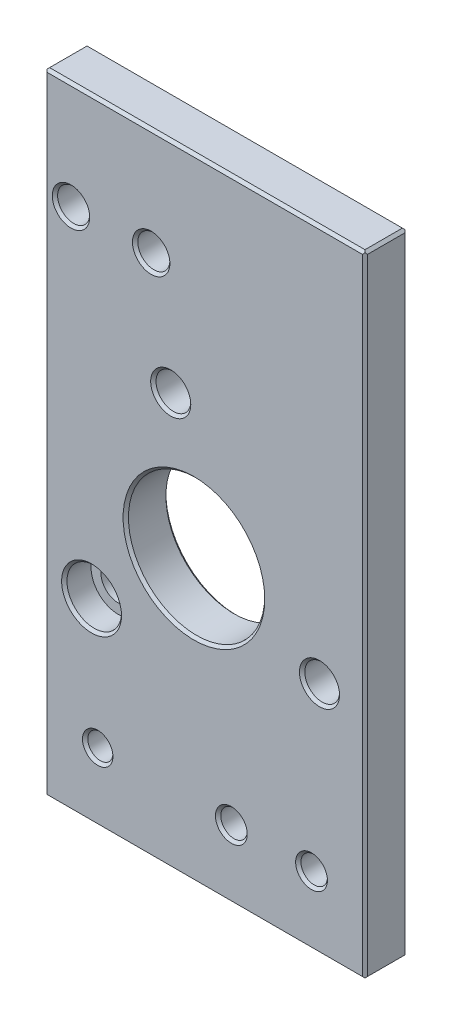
ISO-10303-21;
HEADER;
FILE_DESCRIPTION(('STEP AP214'),'2;1');
FILE_NAME('part.step','',(''),(''),'','','');
FILE_SCHEMA(('AUTOMOTIVE_DESIGN { 1 0 10303 214 1 1 1 1 }'));
ENDSEC;
DATA;
#1=APPLICATION_CONTEXT('core data for automotive mechanical design processes');
#2=APPLICATION_PROTOCOL_DEFINITION('international standard','automotive_design',2000,#1);
#3=PRODUCT_CONTEXT('',#1,'mechanical');
#4=PRODUCT('Part','Part','',(#3));
#5=PRODUCT_RELATED_PRODUCT_CATEGORY('part','',(#4));
#6=PRODUCT_DEFINITION_FORMATION('','',#4);
#7=PRODUCT_DEFINITION_CONTEXT('part definition',#1,'design');
#8=PRODUCT_DEFINITION('design','',#6,#7);
#9=PRODUCT_DEFINITION_SHAPE('','',#8);
#10=(LENGTH_UNIT() NAMED_UNIT(*) SI_UNIT(.MILLI.,.METRE.));
#11=(NAMED_UNIT(*) PLANE_ANGLE_UNIT() SI_UNIT($,.RADIAN.));
#12=(NAMED_UNIT(*) SI_UNIT($,.STERADIAN.) SOLID_ANGLE_UNIT());
#13=UNCERTAINTY_MEASURE_WITH_UNIT(LENGTH_MEASURE(1.E-05),#10,'distance_accuracy_value','');
#14=(GEOMETRIC_REPRESENTATION_CONTEXT(3) GLOBAL_UNCERTAINTY_ASSIGNED_CONTEXT((#13)) GLOBAL_UNIT_ASSIGNED_CONTEXT((#10,
#11,#12)) REPRESENTATION_CONTEXT('',''));
#15=CARTESIAN_POINT('',(0.,0.,0.));
#16=DIRECTION('',(0.,0.,1.));
#17=DIRECTION('',(1.,0.,0.));
#18=AXIS2_PLACEMENT_3D('',#15,#16,#17);
#19=CARTESIAN_POINT('',(8.8488889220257,36.4303097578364,-2.));
#20=DIRECTION('',(0.,0.,1.));
#21=DIRECTION('',(1.,0.,0.));
#22=AXIS2_PLACEMENT_3D('',#19,#20,#21);
#23=CYLINDRICAL_SURFACE('',#22,3.25);
#24=CARTESIAN_POINT('',(8.8488889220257,36.4303097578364,0.500000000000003));
#25=DIRECTION('',(0.,0.,1.));
#26=DIRECTION('',(1.,0.,0.));
#27=AXIS2_PLACEMENT_3D('',#24,#25,#26);
#28=CIRCLE('',#27,3.25);
#29=CARTESIAN_POINT('',(12.0988889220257,36.4303097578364,0.500000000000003));
#30=VERTEX_POINT('',#29);
#31=EDGE_CURVE('E278',#30,#30,#28,.F.);
#32=ORIENTED_EDGE('',*,*,#31,.T.);
#33=EDGE_LOOP('',(#32));
#34=FACE_BOUND('',#33,.T.);
#35=CARTESIAN_POINT('',(8.8488889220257,36.4303097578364,3.));
#36=DIRECTION('',(0.,0.,1.));
#37=DIRECTION('',(1.,0.,0.));
#38=AXIS2_PLACEMENT_3D('',#35,#36,#37);
#39=CIRCLE('',#38,3.25);
#40=CARTESIAN_POINT('',(12.0988889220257,36.4303097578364,3.));
#41=VERTEX_POINT('',#40);
#42=EDGE_CURVE('E368',#41,#41,#39,.F.);
#43=ORIENTED_EDGE('',*,*,#42,.F.);
#44=EDGE_LOOP('',(#43));
#45=FACE_BOUND('',#44,.T.);
#46=ADVANCED_FACE('F34',(#34,#45),#23,.F.);
#47=CARTESIAN_POINT('',(0.,0.,8.));
#48=DIRECTION('',(-1.,0.,0.));
#49=DIRECTION('',(0.,0.,1.));
#50=AXIS2_PLACEMENT_3D('',#47,#48,#49);
#51=PLANE('',#50);
#52=DIRECTION('',(0.,1.,0.));
#53=VECTOR('',#52,1.);
#54=CARTESIAN_POINT('',(0.,0.,7.49999999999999));
#55=LINE('',#54,#53);
#56=CARTESIAN_POINT('',(0.,0.500000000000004,7.49999999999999));
#57=VERTEX_POINT('',#56);
#58=CARTESIAN_POINT('',(0.,117.5,7.5));
#59=VERTEX_POINT('',#58);
#60=EDGE_CURVE('E181',#57,#59,#55,.T.);
#61=ORIENTED_EDGE('',*,*,#60,.T.);
#62=DIRECTION('',(0.,0.,-1.));
#63=VECTOR('',#62,1.);
#64=CARTESIAN_POINT('',(0.,117.5,0.500000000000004));
#65=LINE('',#64,#63);
#66=CARTESIAN_POINT('',(0.,117.5,0.50000000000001));
#67=VERTEX_POINT('',#66);
#68=EDGE_CURVE('E327',#59,#67,#65,.T.);
#69=ORIENTED_EDGE('',*,*,#68,.T.);
#70=DIRECTION('',(0.,-1.,0.));
#71=VECTOR('',#70,1.);
#72=CARTESIAN_POINT('',(0.,0.,0.500000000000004));
#73=LINE('',#72,#71);
#74=CARTESIAN_POINT('',(0.,0.500000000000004,0.500000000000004));
#75=VERTEX_POINT('',#74);
#76=EDGE_CURVE('E255',#67,#75,#73,.T.);
#77=ORIENTED_EDGE('',*,*,#76,.T.);
#78=DIRECTION('',(0.,0.,1.));
#79=VECTOR('',#78,1.);
#80=CARTESIAN_POINT('',(0.,0.500000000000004,7.49999999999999));
#81=LINE('',#80,#79);
#82=EDGE_CURVE('E307',#75,#57,#81,.T.);
#83=ORIENTED_EDGE('',*,*,#82,.T.);
#84=EDGE_LOOP('',(#61,#69,#77,#83));
#85=FACE_BOUND('',#84,.T.);
#86=ADVANCED_FACE('F36',(#85),#51,.T.);
#87=CARTESIAN_POINT('',(0.,0.,8.));
#88=DIRECTION('',(0.,1.,0.));
#89=DIRECTION('',(-1.,0.,0.));
#90=AXIS2_PLACEMENT_3D('',#87,#88,#89);
#91=PLANE('',#90);
#92=DIRECTION('',(-1.,0.,0.));
#93=VECTOR('',#92,1.);
#94=CARTESIAN_POINT('',(0.,0.,7.5));
#95=LINE('',#94,#93);
#96=CARTESIAN_POINT('',(59.5,0.,7.5));
#97=VERTEX_POINT('',#96);
#98=CARTESIAN_POINT('',(0.500000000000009,0.,7.5));
#99=VERTEX_POINT('',#98);
#100=EDGE_CURVE('E178',#97,#99,#95,.T.);
#101=ORIENTED_EDGE('',*,*,#100,.T.);
#102=DIRECTION('',(0.,0.,-1.));
#103=VECTOR('',#102,1.);
#104=CARTESIAN_POINT('',(0.500000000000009,0.,0.500000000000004));
#105=LINE('',#104,#103);
#106=CARTESIAN_POINT('',(0.500000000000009,0.,0.500000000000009));
#107=VERTEX_POINT('',#106);
#108=EDGE_CURVE('E299',#99,#107,#105,.T.);
#109=ORIENTED_EDGE('',*,*,#108,.T.);
#110=DIRECTION('',(1.,0.,0.));
#111=VECTOR('',#110,1.);
#112=CARTESIAN_POINT('',(0.,0.,0.500000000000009));
#113=LINE('',#112,#111);
#114=CARTESIAN_POINT('',(59.5,0.,0.500000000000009));
#115=VERTEX_POINT('',#114);
#116=EDGE_CURVE('E211',#107,#115,#113,.T.);
#117=ORIENTED_EDGE('',*,*,#116,.T.);
#118=DIRECTION('',(0.,0.,1.));
#119=VECTOR('',#118,1.);
#120=CARTESIAN_POINT('',(59.5,0.,7.5));
#121=LINE('',#120,#119);
#122=EDGE_CURVE('E292',#115,#97,#121,.T.);
#123=ORIENTED_EDGE('',*,*,#122,.T.);
#124=EDGE_LOOP('',(#101,#109,#117,#123));
#125=FACE_BOUND('',#124,.T.);
#126=ADVANCED_FACE('F432',(#125),#91,.F.);
#127=CARTESIAN_POINT('',(60.,118.,8.));
#128=DIRECTION('',(1.,0.,0.));
#129=DIRECTION('',(0.,1.,0.));
#130=AXIS2_PLACEMENT_3D('',#127,#128,#129);
#131=PLANE('',#130);
#132=DIRECTION('',(0.,1.,0.));
#133=VECTOR('',#132,1.);
#134=CARTESIAN_POINT('',(60.,118.,0.500000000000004));
#135=LINE('',#134,#133);
#136=CARTESIAN_POINT('',(60.,0.49999999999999,0.499999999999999));
#137=VERTEX_POINT('',#136);
#138=CARTESIAN_POINT('',(60.,117.5,0.500000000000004));
#139=VERTEX_POINT('',#138);
#140=EDGE_CURVE('E250',#137,#139,#135,.T.);
#141=ORIENTED_EDGE('',*,*,#140,.T.);
#142=DIRECTION('',(0.,0.,1.));
#143=VECTOR('',#142,1.);
#144=CARTESIAN_POINT('',(60.,117.5,7.49999999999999));
#145=LINE('',#144,#143);
#146=CARTESIAN_POINT('',(60.,117.5,7.49999999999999));
#147=VERTEX_POINT('',#146);
#148=EDGE_CURVE('E320',#139,#147,#145,.T.);
#149=ORIENTED_EDGE('',*,*,#148,.T.);
#150=DIRECTION('',(0.,-1.,0.));
#151=VECTOR('',#150,1.);
#152=CARTESIAN_POINT('',(60.,118.,7.49999999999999));
#153=LINE('',#152,#151);
#154=CARTESIAN_POINT('',(60.,0.500000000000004,7.49999999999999));
#155=VERTEX_POINT('',#154);
#156=EDGE_CURVE('E172',#147,#155,#153,.T.);
#157=ORIENTED_EDGE('',*,*,#156,.T.);
#158=DIRECTION('',(0.,0.,-1.));
#159=VECTOR('',#158,1.);
#160=CARTESIAN_POINT('',(60.,0.500000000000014,0.500000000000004));
#161=LINE('',#160,#159);
#162=EDGE_CURVE('E284',#155,#137,#161,.T.);
#163=ORIENTED_EDGE('',*,*,#162,.T.);
#164=EDGE_LOOP('',(#141,#149,#157,#163));
#165=FACE_BOUND('',#164,.T.);
#166=ADVANCED_FACE('F517',(#165),#131,.T.);
#167=CARTESIAN_POINT('',(60.,118.,8.));
#168=DIRECTION('',(0.,-1.,0.));
#169=DIRECTION('',(0.,0.,-1.));
#170=AXIS2_PLACEMENT_3D('',#167,#168,#169);
#171=PLANE('',#170);
#172=DIRECTION('',(-1.,0.,0.));
#173=VECTOR('',#172,1.);
#174=CARTESIAN_POINT('',(60.,118.,0.500000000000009));
#175=LINE('',#174,#173);
#176=CARTESIAN_POINT('',(59.5,118.,0.500000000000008));
#177=VERTEX_POINT('',#176);
#178=CARTESIAN_POINT('',(0.5,118.,0.500000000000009));
#179=VERTEX_POINT('',#178);
#180=EDGE_CURVE('E253',#177,#179,#175,.T.);
#181=ORIENTED_EDGE('',*,*,#180,.T.);
#182=DIRECTION('',(0.,0.,1.));
#183=VECTOR('',#182,1.);
#184=CARTESIAN_POINT('',(0.5,118.,7.49999999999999));
#185=LINE('',#184,#183);
#186=CARTESIAN_POINT('',(0.499999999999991,118.,7.5));
#187=VERTEX_POINT('',#186);
#188=EDGE_CURVE('E56',#179,#187,#185,.T.);
#189=ORIENTED_EDGE('',*,*,#188,.T.);
#190=DIRECTION('',(1.,0.,0.));
#191=VECTOR('',#190,1.);
#192=CARTESIAN_POINT('',(60.,118.,7.5));
#193=LINE('',#192,#191);
#194=CARTESIAN_POINT('',(59.5,118.,7.5));
#195=VERTEX_POINT('',#194);
#196=EDGE_CURVE('E170',#187,#195,#193,.T.);
#197=ORIENTED_EDGE('',*,*,#196,.T.);
#198=DIRECTION('',(0.,0.,-1.));
#199=VECTOR('',#198,1.);
#200=CARTESIAN_POINT('',(59.5,118.,0.500000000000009));
#201=LINE('',#200,#199);
#202=EDGE_CURVE('E313',#195,#177,#201,.T.);
#203=ORIENTED_EDGE('',*,*,#202,.T.);
#204=EDGE_LOOP('',(#181,#189,#197,#203));
#205=FACE_BOUND('',#204,.T.);
#206=ADVANCED_FACE('F341',(#205),#171,.F.);
#207=CARTESIAN_POINT('',(0.,118.,8.));
#208=DIRECTION('',(0.,0.,1.));
#209=DIRECTION('',(1.,0.,0.));
#210=AXIS2_PLACEMENT_3D('',#207,#208,#209);
#211=PLANE('',#210);
#212=DIRECTION('',(0.,1.,0.));
#213=VECTOR('',#212,1.);
#214=CARTESIAN_POINT('',(59.5,118.,8.));
#215=LINE('',#214,#213);
#216=CARTESIAN_POINT('',(59.5,0.500000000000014,8.));
#217=VERTEX_POINT('',#216);
#218=CARTESIAN_POINT('',(59.5,117.5,8.));
#219=VERTEX_POINT('',#218);
#220=EDGE_CURVE('E168',#217,#219,#215,.T.);
#221=ORIENTED_EDGE('',*,*,#220,.T.);
#222=DIRECTION('',(-1.,0.,0.));
#223=VECTOR('',#222,1.);
#224=CARTESIAN_POINT('',(0.,117.5,8.));
#225=LINE('',#224,#223);
#226=CARTESIAN_POINT('',(0.500000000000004,117.5,8.));
#227=VERTEX_POINT('',#226);
#228=EDGE_CURVE('E149',#219,#227,#225,.T.);
#229=ORIENTED_EDGE('',*,*,#228,.T.);
#230=DIRECTION('',(0.,-1.,0.));
#231=VECTOR('',#230,1.);
#232=CARTESIAN_POINT('',(0.500000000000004,118.,8.));
#233=LINE('',#232,#231);
#234=CARTESIAN_POINT('',(0.500000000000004,0.500000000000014,8.));
#235=VERTEX_POINT('',#234);
#236=EDGE_CURVE('E156',#227,#235,#233,.T.);
#237=ORIENTED_EDGE('',*,*,#236,.T.);
#238=DIRECTION('',(1.,0.,0.));
#239=VECTOR('',#238,1.);
#240=CARTESIAN_POINT('',(60.,0.500000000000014,8.));
#241=LINE('',#240,#239);
#242=EDGE_CURVE('E162',#235,#217,#241,.T.);
#243=ORIENTED_EDGE('',*,*,#242,.T.);
#244=EDGE_LOOP('',(#221,#229,#237,#243));
#245=FACE_BOUND('',#244,.T.);
#246=CARTESIAN_POINT('',(28.,52.5,8.));
#247=DIRECTION('',(0.,0.,1.));
#248=DIRECTION('',(1.,0.,0.));
#249=AXIS2_PLACEMENT_3D('',#246,#247,#248);
#250=CIRCLE('',#249,13.25);
#251=CARTESIAN_POINT('',(41.25,52.5,8.));
#252=VERTEX_POINT('',#251);
#253=EDGE_CURVE('E163',#252,#252,#250,.F.);
#254=ORIENTED_EDGE('',*,*,#253,.T.);
#255=EDGE_LOOP('',(#254));
#256=FACE_BOUND('',#255,.T.);
#257=CARTESIAN_POINT('',(5.,98.,8.));
#258=DIRECTION('',(0.,0.,1.));
#259=DIRECTION('',(1.,0.,0.));
#260=AXIS2_PLACEMENT_3D('',#257,#258,#259);
#261=CIRCLE('',#260,3.5);
#262=CARTESIAN_POINT('',(8.5,98.,8.));
#263=VERTEX_POINT('',#262);
#264=EDGE_CURVE('E392',#263,#263,#261,.F.);
#265=ORIENTED_EDGE('',*,*,#264,.T.);
#266=EDGE_LOOP('',(#265));
#267=FACE_BOUND('',#266,.T.);
#268=CARTESIAN_POINT('',(20.,98.,8.));
#269=DIRECTION('',(0.,0.,1.));
#270=DIRECTION('',(1.,0.,0.));
#271=AXIS2_PLACEMENT_3D('',#268,#269,#270);
#272=CIRCLE('',#271,3.5);
#273=CARTESIAN_POINT('',(23.5,98.,8.));
#274=VERTEX_POINT('',#273);
#275=EDGE_CURVE('E389',#274,#274,#272,.F.);
#276=ORIENTED_EDGE('',*,*,#275,.T.);
#277=EDGE_LOOP('',(#276));
#278=FACE_BOUND('',#277,.T.);
#279=CARTESIAN_POINT('',(10.,12.8,8.));
#280=DIRECTION('',(0.,0.,1.));
#281=DIRECTION('',(1.,0.,0.));
#282=AXIS2_PLACEMENT_3D('',#279,#280,#281);
#283=CIRCLE('',#282,2.8475);
#284=CARTESIAN_POINT('',(12.8475,12.8,8.));
#285=VERTEX_POINT('',#284);
#286=EDGE_CURVE('E386',#285,#285,#283,.F.);
#287=ORIENTED_EDGE('',*,*,#286,.T.);
#288=EDGE_LOOP('',(#287));
#289=FACE_BOUND('',#288,.T.);
#290=CARTESIAN_POINT('',(35.,12.8,8.));
#291=DIRECTION('',(0.,0.,1.));
#292=DIRECTION('',(1.,0.,0.));
#293=AXIS2_PLACEMENT_3D('',#290,#291,#292);
#294=CIRCLE('',#293,2.975);
#295=CARTESIAN_POINT('',(37.975,12.8,8.));
#296=VERTEX_POINT('',#295);
#297=EDGE_CURVE('E383',#296,#296,#294,.F.);
#298=ORIENTED_EDGE('',*,*,#297,.T.);
#299=EDGE_LOOP('',(#298));
#300=FACE_BOUND('',#299,.T.);
#301=CARTESIAN_POINT('',(50.,12.8,8.));
#302=DIRECTION('',(0.,0.,1.));
#303=DIRECTION('',(1.,0.,0.));
#304=AXIS2_PLACEMENT_3D('',#301,#302,#303);
#305=CIRCLE('',#304,2.975);
#306=CARTESIAN_POINT('',(52.975,12.8,8.));
#307=VERTEX_POINT('',#306);
#308=EDGE_CURVE('E380',#307,#307,#305,.F.);
#309=ORIENTED_EDGE('',*,*,#308,.T.);
#310=EDGE_LOOP('',(#309));
#311=FACE_BOUND('',#310,.T.);
#312=CARTESIAN_POINT('',(23.6587955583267,77.1201938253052,8.));
#313=DIRECTION('',(0.,0.,1.));
#314=DIRECTION('',(1.,0.,0.));
#315=AXIS2_PLACEMENT_3D('',#312,#313,#314);
#316=CIRCLE('',#315,3.75000000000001);
#317=CARTESIAN_POINT('',(27.4087955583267,77.1201938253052,8.));
#318=VERTEX_POINT('',#317);
#319=EDGE_CURVE('E377',#318,#318,#316,.F.);
#320=ORIENTED_EDGE('',*,*,#319,.T.);
#321=EDGE_LOOP('',(#320));
#322=FACE_BOUND('',#321,.T.);
#323=CARTESIAN_POINT('',(51.4923155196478,43.9494964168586,8.));
#324=DIRECTION('',(0.,0.,1.));
#325=DIRECTION('',(1.,0.,0.));
#326=AXIS2_PLACEMENT_3D('',#323,#324,#325);
#327=CIRCLE('',#326,3.75000000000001);
#328=CARTESIAN_POINT('',(55.2423155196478,43.9494964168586,8.));
#329=VERTEX_POINT('',#328);
#330=EDGE_CURVE('E374',#329,#329,#327,.F.);
#331=ORIENTED_EDGE('',*,*,#330,.T.);
#332=EDGE_LOOP('',(#331));
#333=FACE_BOUND('',#332,.T.);
#334=CARTESIAN_POINT('',(8.8488889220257,36.4303097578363,8.));
#335=DIRECTION('',(0.,0.,1.));
#336=DIRECTION('',(1.,0.,0.));
#337=AXIS2_PLACEMENT_3D('',#334,#335,#336);
#338=CIRCLE('',#337,5.60000000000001);
#339=CARTESIAN_POINT('',(14.4488889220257,36.4303097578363,8.));
#340=VERTEX_POINT('',#339);
#341=EDGE_CURVE('E371',#340,#340,#338,.F.);
#342=ORIENTED_EDGE('',*,*,#341,.T.);
#343=EDGE_LOOP('',(#342));
#344=FACE_BOUND('',#343,.T.);
#345=ADVANCED_FACE('F165',(#245,#256,#267,#278,#289,#300,#311,#322,#333,#344),#211,.T.);
#346=CARTESIAN_POINT('',(0.,118.,0.));
#347=DIRECTION('',(0.,0.,1.));
#348=DIRECTION('',(1.,0.,0.));
#349=AXIS2_PLACEMENT_3D('',#346,#347,#348);
#350=PLANE('',#349);
#351=DIRECTION('',(0.,-1.,0.));
#352=VECTOR('',#351,1.);
#353=CARTESIAN_POINT('',(59.5,0.,0.));
#354=LINE('',#353,#352);
#355=CARTESIAN_POINT('',(59.5,117.5,0.));
#356=VERTEX_POINT('',#355);
#357=CARTESIAN_POINT('',(59.5,0.5,0.));
#358=VERTEX_POINT('',#357);
#359=EDGE_CURVE('E245',#356,#358,#354,.T.);
#360=ORIENTED_EDGE('',*,*,#359,.T.);
#361=DIRECTION('',(-1.,0.,0.));
#362=VECTOR('',#361,1.);
#363=CARTESIAN_POINT('',(0.,0.5,0.));
#364=LINE('',#363,#362);
#365=CARTESIAN_POINT('',(0.500000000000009,0.5,0.));
#366=VERTEX_POINT('',#365);
#367=EDGE_CURVE('E247',#358,#366,#364,.T.);
#368=ORIENTED_EDGE('',*,*,#367,.T.);
#369=DIRECTION('',(0.,1.,0.));
#370=VECTOR('',#369,1.);
#371=CARTESIAN_POINT('',(0.500000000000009,118.,0.));
#372=LINE('',#371,#370);
#373=CARTESIAN_POINT('',(0.500000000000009,117.5,0.));
#374=VERTEX_POINT('',#373);
#375=EDGE_CURVE('E240',#366,#374,#372,.T.);
#376=ORIENTED_EDGE('',*,*,#375,.T.);
#377=DIRECTION('',(1.,0.,0.));
#378=VECTOR('',#377,1.);
#379=CARTESIAN_POINT('',(0.,117.5,0.));
#380=LINE('',#379,#378);
#381=EDGE_CURVE('E243',#374,#356,#380,.T.);
#382=ORIENTED_EDGE('',*,*,#381,.T.);
#383=EDGE_LOOP('',(#360,#368,#376,#382));
#384=FACE_BOUND('',#383,.T.);
#385=CARTESIAN_POINT('',(28.,52.5,0.));
#386=DIRECTION('',(0.,0.,1.));
#387=DIRECTION('',(1.,0.,0.));
#388=AXIS2_PLACEMENT_3D('',#385,#386,#387);
#389=CIRCLE('',#388,13.25);
#390=CARTESIAN_POINT('',(41.25,52.5,0.));
#391=VERTEX_POINT('',#390);
#392=EDGE_CURVE('E237',#391,#391,#389,.T.);
#393=ORIENTED_EDGE('',*,*,#392,.T.);
#394=EDGE_LOOP('',(#393));
#395=FACE_BOUND('',#394,.T.);
#396=CARTESIAN_POINT('',(5.,98.,0.));
#397=DIRECTION('',(0.,0.,1.));
#398=DIRECTION('',(1.,0.,0.));
#399=AXIS2_PLACEMENT_3D('',#396,#397,#398);
#400=CIRCLE('',#399,3.50000000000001);
#401=CARTESIAN_POINT('',(8.50000000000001,98.,0.));
#402=VERTEX_POINT('',#401);
#403=EDGE_CURVE('E234',#402,#402,#400,.T.);
#404=ORIENTED_EDGE('',*,*,#403,.T.);
#405=EDGE_LOOP('',(#404));
#406=FACE_BOUND('',#405,.T.);
#407=CARTESIAN_POINT('',(20.,98.,0.));
#408=DIRECTION('',(0.,0.,1.));
#409=DIRECTION('',(1.,0.,0.));
#410=AXIS2_PLACEMENT_3D('',#407,#408,#409);
#411=CIRCLE('',#410,3.50000000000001);
#412=CARTESIAN_POINT('',(23.5,98.,0.));
#413=VERTEX_POINT('',#412);
#414=EDGE_CURVE('E231',#413,#413,#411,.T.);
#415=ORIENTED_EDGE('',*,*,#414,.T.);
#416=EDGE_LOOP('',(#415));
#417=FACE_BOUND('',#416,.T.);
#418=CARTESIAN_POINT('',(10.,12.8,0.));
#419=DIRECTION('',(0.,0.,1.));
#420=DIRECTION('',(1.,0.,0.));
#421=AXIS2_PLACEMENT_3D('',#418,#419,#420);
#422=CIRCLE('',#421,2.84750000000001);
#423=CARTESIAN_POINT('',(12.8475,12.8,0.));
#424=VERTEX_POINT('',#423);
#425=EDGE_CURVE('E228',#424,#424,#422,.T.);
#426=ORIENTED_EDGE('',*,*,#425,.T.);
#427=EDGE_LOOP('',(#426));
#428=FACE_BOUND('',#427,.T.);
#429=CARTESIAN_POINT('',(35.,12.8,0.));
#430=DIRECTION('',(0.,0.,1.));
#431=DIRECTION('',(1.,0.,0.));
#432=AXIS2_PLACEMENT_3D('',#429,#430,#431);
#433=CIRCLE('',#432,2.97500000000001);
#434=CARTESIAN_POINT('',(37.975,12.8,0.));
#435=VERTEX_POINT('',#434);
#436=EDGE_CURVE('E225',#435,#435,#433,.T.);
#437=ORIENTED_EDGE('',*,*,#436,.T.);
#438=EDGE_LOOP('',(#437));
#439=FACE_BOUND('',#438,.T.);
#440=CARTESIAN_POINT('',(50.,12.8,0.));
#441=DIRECTION('',(0.,0.,1.));
#442=DIRECTION('',(1.,0.,0.));
#443=AXIS2_PLACEMENT_3D('',#440,#441,#442);
#444=CIRCLE('',#443,2.97500000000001);
#445=CARTESIAN_POINT('',(52.975,12.8,0.));
#446=VERTEX_POINT('',#445);
#447=EDGE_CURVE('E222',#446,#446,#444,.T.);
#448=ORIENTED_EDGE('',*,*,#447,.T.);
#449=EDGE_LOOP('',(#448));
#450=FACE_BOUND('',#449,.T.);
#451=CARTESIAN_POINT('',(23.6587955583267,77.1201938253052,0.));
#452=DIRECTION('',(0.,0.,1.));
#453=DIRECTION('',(1.,0.,0.));
#454=AXIS2_PLACEMENT_3D('',#451,#452,#453);
#455=CIRCLE('',#454,3.75000000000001);
#456=CARTESIAN_POINT('',(27.4087955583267,77.1201938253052,0.));
#457=VERTEX_POINT('',#456);
#458=EDGE_CURVE('E219',#457,#457,#455,.T.);
#459=ORIENTED_EDGE('',*,*,#458,.T.);
#460=EDGE_LOOP('',(#459));
#461=FACE_BOUND('',#460,.T.);
#462=CARTESIAN_POINT('',(8.8488889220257,36.4303097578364,0.));
#463=DIRECTION('',(0.,0.,1.));
#464=DIRECTION('',(1.,0.,0.));
#465=AXIS2_PLACEMENT_3D('',#462,#463,#464);
#466=CIRCLE('',#465,3.75000000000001);
#467=CARTESIAN_POINT('',(12.5988889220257,36.4303097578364,0.));
#468=VERTEX_POINT('',#467);
#469=EDGE_CURVE('E216',#468,#468,#466,.T.);
#470=ORIENTED_EDGE('',*,*,#469,.T.);
#471=EDGE_LOOP('',(#470));
#472=FACE_BOUND('',#471,.T.);
#473=CARTESIAN_POINT('',(51.4923155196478,43.9494964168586,0.));
#474=DIRECTION('',(0.,0.,1.));
#475=DIRECTION('',(1.,0.,0.));
#476=AXIS2_PLACEMENT_3D('',#473,#474,#475);
#477=CIRCLE('',#476,3.75000000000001);
#478=CARTESIAN_POINT('',(55.2423155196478,43.9494964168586,0.));
#479=VERTEX_POINT('',#478);
#480=EDGE_CURVE('E213',#479,#479,#477,.T.);
#481=ORIENTED_EDGE('',*,*,#480,.T.);
#482=EDGE_LOOP('',(#481));
#483=FACE_BOUND('',#482,.T.);
#484=ADVANCED_FACE('F438',(#384,#395,#406,#417,#428,#439,#450,#461,#472,#483),#350,.F.);
#485=CARTESIAN_POINT('',(28.,52.5,-2.));
#486=DIRECTION('',(0.,0.,1.));
#487=DIRECTION('',(1.,0.,0.));
#488=AXIS2_PLACEMENT_3D('',#485,#486,#487);
#489=CYLINDRICAL_SURFACE('',#488,12.75);
#490=CARTESIAN_POINT('',(28.,52.5,0.500000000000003));
#491=DIRECTION('',(0.,0.,1.));
#492=DIRECTION('',(1.,0.,0.));
#493=AXIS2_PLACEMENT_3D('',#490,#491,#492);
#494=CIRCLE('',#493,12.75);
#495=CARTESIAN_POINT('',(40.75,52.5,0.500000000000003));
#496=VERTEX_POINT('',#495);
#497=EDGE_CURVE('E257',#496,#496,#494,.F.);
#498=ORIENTED_EDGE('',*,*,#497,.T.);
#499=EDGE_LOOP('',(#498));
#500=FACE_BOUND('',#499,.T.);
#501=CARTESIAN_POINT('',(28.,52.5,7.49999999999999));
#502=DIRECTION('',(0.,0.,1.));
#503=DIRECTION('',(1.,0.,0.));
#504=AXIS2_PLACEMENT_3D('',#501,#502,#503);
#505=CIRCLE('',#504,12.75);
#506=CARTESIAN_POINT('',(40.75,52.5,7.49999999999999));
#507=VERTEX_POINT('',#506);
#508=EDGE_CURVE('E184',#507,#507,#505,.T.);
#509=ORIENTED_EDGE('',*,*,#508,.T.);
#510=EDGE_LOOP('',(#509));
#511=FACE_BOUND('',#510,.T.);
#512=ADVANCED_FACE('F441',(#500,#511),#489,.F.);
#513=CARTESIAN_POINT('',(5.,98.,-2.));
#514=DIRECTION('',(0.,0.,1.));
#515=DIRECTION('',(1.,0.,0.));
#516=AXIS2_PLACEMENT_3D('',#513,#514,#515);
#517=CYLINDRICAL_SURFACE('',#516,3.);
#518=CARTESIAN_POINT('',(5.,98.,0.500000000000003));
#519=DIRECTION('',(0.,0.,1.));
#520=DIRECTION('',(1.,0.,0.));
#521=AXIS2_PLACEMENT_3D('',#518,#519,#520);
#522=CIRCLE('',#521,3.);
#523=CARTESIAN_POINT('',(8.,98.,0.500000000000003));
#524=VERTEX_POINT('',#523);
#525=EDGE_CURVE('E260',#524,#524,#522,.F.);
#526=ORIENTED_EDGE('',*,*,#525,.T.);
#527=EDGE_LOOP('',(#526));
#528=FACE_BOUND('',#527,.T.);
#529=CARTESIAN_POINT('',(5.,98.,7.49999999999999));
#530=DIRECTION('',(0.,0.,1.));
#531=DIRECTION('',(1.,0.,0.));
#532=AXIS2_PLACEMENT_3D('',#529,#530,#531);
#533=CIRCLE('',#532,3.);
#534=CARTESIAN_POINT('',(8.,98.,7.49999999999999));
#535=VERTEX_POINT('',#534);
#536=EDGE_CURVE('E187',#535,#535,#533,.T.);
#537=ORIENTED_EDGE('',*,*,#536,.T.);
#538=EDGE_LOOP('',(#537));
#539=FACE_BOUND('',#538,.T.);
#540=ADVANCED_FACE('F505',(#528,#539),#517,.F.);
#541=CARTESIAN_POINT('',(20.,98.,-2.));
#542=DIRECTION('',(0.,0.,1.));
#543=DIRECTION('',(1.,0.,0.));
#544=AXIS2_PLACEMENT_3D('',#541,#542,#543);
#545=CYLINDRICAL_SURFACE('',#544,3.);
#546=CARTESIAN_POINT('',(20.,98.,0.500000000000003));
#547=DIRECTION('',(0.,0.,1.));
#548=DIRECTION('',(1.,0.,0.));
#549=AXIS2_PLACEMENT_3D('',#546,#547,#548);
#550=CIRCLE('',#549,3.);
#551=CARTESIAN_POINT('',(23.,98.,0.500000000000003));
#552=VERTEX_POINT('',#551);
#553=EDGE_CURVE('E263',#552,#552,#550,.F.);
#554=ORIENTED_EDGE('',*,*,#553,.T.);
#555=EDGE_LOOP('',(#554));
#556=FACE_BOUND('',#555,.T.);
#557=CARTESIAN_POINT('',(20.,98.,7.49999999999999));
#558=DIRECTION('',(0.,0.,1.));
#559=DIRECTION('',(1.,0.,0.));
#560=AXIS2_PLACEMENT_3D('',#557,#558,#559);
#561=CIRCLE('',#560,3.);
#562=CARTESIAN_POINT('',(23.,98.,7.49999999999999));
#563=VERTEX_POINT('',#562);
#564=EDGE_CURVE('E190',#563,#563,#561,.T.);
#565=ORIENTED_EDGE('',*,*,#564,.T.);
#566=EDGE_LOOP('',(#565));
#567=FACE_BOUND('',#566,.T.);
#568=ADVANCED_FACE('F501',(#556,#567),#545,.F.);
#569=CARTESIAN_POINT('',(10.,12.8,-2.));
#570=DIRECTION('',(0.,0.,1.));
#571=DIRECTION('',(1.,0.,0.));
#572=AXIS2_PLACEMENT_3D('',#569,#570,#571);
#573=CYLINDRICAL_SURFACE('',#572,2.3475);
#574=CARTESIAN_POINT('',(10.,12.8,0.500000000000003));
#575=DIRECTION('',(0.,0.,1.));
#576=DIRECTION('',(1.,0.,0.));
#577=AXIS2_PLACEMENT_3D('',#574,#575,#576);
#578=CIRCLE('',#577,2.3475);
#579=CARTESIAN_POINT('',(12.3475,12.8,0.500000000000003));
#580=VERTEX_POINT('',#579);
#581=EDGE_CURVE('E266',#580,#580,#578,.F.);
#582=ORIENTED_EDGE('',*,*,#581,.T.);
#583=EDGE_LOOP('',(#582));
#584=FACE_BOUND('',#583,.T.);
#585=CARTESIAN_POINT('',(10.,12.8,7.49999999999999));
#586=DIRECTION('',(0.,0.,1.));
#587=DIRECTION('',(1.,0.,0.));
#588=AXIS2_PLACEMENT_3D('',#585,#586,#587);
#589=CIRCLE('',#588,2.3475);
#590=CARTESIAN_POINT('',(12.3475,12.8,7.49999999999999));
#591=VERTEX_POINT('',#590);
#592=EDGE_CURVE('E193',#591,#591,#589,.T.);
#593=ORIENTED_EDGE('',*,*,#592,.T.);
#594=EDGE_LOOP('',(#593));
#595=FACE_BOUND('',#594,.T.);
#596=ADVANCED_FACE('F497',(#584,#595),#573,.F.);
#597=CARTESIAN_POINT('',(35.,12.8,-2.));
#598=DIRECTION('',(0.,0.,1.));
#599=DIRECTION('',(1.,0.,0.));
#600=AXIS2_PLACEMENT_3D('',#597,#598,#599);
#601=CYLINDRICAL_SURFACE('',#600,2.475);
#602=CARTESIAN_POINT('',(35.,12.8,0.500000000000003));
#603=DIRECTION('',(0.,0.,1.));
#604=DIRECTION('',(1.,0.,0.));
#605=AXIS2_PLACEMENT_3D('',#602,#603,#604);
#606=CIRCLE('',#605,2.475);
#607=CARTESIAN_POINT('',(37.475,12.8,0.500000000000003));
#608=VERTEX_POINT('',#607);
#609=EDGE_CURVE('E269',#608,#608,#606,.F.);
#610=ORIENTED_EDGE('',*,*,#609,.T.);
#611=EDGE_LOOP('',(#610));
#612=FACE_BOUND('',#611,.T.);
#613=CARTESIAN_POINT('',(35.,12.8,7.49999999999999));
#614=DIRECTION('',(0.,0.,1.));
#615=DIRECTION('',(1.,0.,0.));
#616=AXIS2_PLACEMENT_3D('',#613,#614,#615);
#617=CIRCLE('',#616,2.475);
#618=CARTESIAN_POINT('',(37.475,12.8,7.49999999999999));
#619=VERTEX_POINT('',#618);
#620=EDGE_CURVE('E196',#619,#619,#617,.T.);
#621=ORIENTED_EDGE('',*,*,#620,.T.);
#622=EDGE_LOOP('',(#621));
#623=FACE_BOUND('',#622,.T.);
#624=ADVANCED_FACE('F493',(#612,#623),#601,.F.);
#625=CARTESIAN_POINT('',(50.,12.8,-2.));
#626=DIRECTION('',(0.,0.,1.));
#627=DIRECTION('',(1.,0.,0.));
#628=AXIS2_PLACEMENT_3D('',#625,#626,#627);
#629=CYLINDRICAL_SURFACE('',#628,2.475);
#630=CARTESIAN_POINT('',(50.,12.8,0.500000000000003));
#631=DIRECTION('',(0.,0.,1.));
#632=DIRECTION('',(1.,0.,0.));
#633=AXIS2_PLACEMENT_3D('',#630,#631,#632);
#634=CIRCLE('',#633,2.475);
#635=CARTESIAN_POINT('',(52.475,12.8,0.500000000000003));
#636=VERTEX_POINT('',#635);
#637=EDGE_CURVE('E272',#636,#636,#634,.F.);
#638=ORIENTED_EDGE('',*,*,#637,.T.);
#639=EDGE_LOOP('',(#638));
#640=FACE_BOUND('',#639,.T.);
#641=CARTESIAN_POINT('',(50.,12.8,7.49999999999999));
#642=DIRECTION('',(0.,0.,1.));
#643=DIRECTION('',(1.,0.,0.));
#644=AXIS2_PLACEMENT_3D('',#641,#642,#643);
#645=CIRCLE('',#644,2.475);
#646=CARTESIAN_POINT('',(52.475,12.8,7.49999999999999));
#647=VERTEX_POINT('',#646);
#648=EDGE_CURVE('E199',#647,#647,#645,.T.);
#649=ORIENTED_EDGE('',*,*,#648,.T.);
#650=EDGE_LOOP('',(#649));
#651=FACE_BOUND('',#650,.T.);
#652=ADVANCED_FACE('F489',(#640,#651),#629,.F.);
#653=CARTESIAN_POINT('',(23.6587955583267,77.1201938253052,-2.));
#654=DIRECTION('',(0.,0.,1.));
#655=DIRECTION('',(1.,0.,0.));
#656=AXIS2_PLACEMENT_3D('',#653,#654,#655);
#657=CYLINDRICAL_SURFACE('',#656,3.25);
#658=CARTESIAN_POINT('',(23.6587955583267,77.1201938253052,0.500000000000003));
#659=DIRECTION('',(0.,0.,1.));
#660=DIRECTION('',(1.,0.,0.));
#661=AXIS2_PLACEMENT_3D('',#658,#659,#660);
#662=CIRCLE('',#661,3.25);
#663=CARTESIAN_POINT('',(26.9087955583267,77.1201938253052,0.500000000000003));
#664=VERTEX_POINT('',#663);
#665=EDGE_CURVE('E275',#664,#664,#662,.F.);
#666=ORIENTED_EDGE('',*,*,#665,.T.);
#667=EDGE_LOOP('',(#666));
#668=FACE_BOUND('',#667,.T.);
#669=CARTESIAN_POINT('',(23.6587955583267,77.1201938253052,7.49999999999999));
#670=DIRECTION('',(0.,0.,1.));
#671=DIRECTION('',(1.,0.,0.));
#672=AXIS2_PLACEMENT_3D('',#669,#670,#671);
#673=CIRCLE('',#672,3.25);
#674=CARTESIAN_POINT('',(26.9087955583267,77.1201938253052,7.49999999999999));
#675=VERTEX_POINT('',#674);
#676=EDGE_CURVE('E202',#675,#675,#673,.T.);
#677=ORIENTED_EDGE('',*,*,#676,.T.);
#678=EDGE_LOOP('',(#677));
#679=FACE_BOUND('',#678,.T.);
#680=ADVANCED_FACE('F486',(#668,#679),#657,.F.);
#681=CARTESIAN_POINT('',(51.4923155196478,43.9494964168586,-2.));
#682=DIRECTION('',(0.,0.,1.));
#683=DIRECTION('',(1.,0.,0.));
#684=AXIS2_PLACEMENT_3D('',#681,#682,#683);
#685=CYLINDRICAL_SURFACE('',#684,3.25);
#686=CARTESIAN_POINT('',(51.4923155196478,43.9494964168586,0.500000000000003));
#687=DIRECTION('',(0.,0.,1.));
#688=DIRECTION('',(1.,0.,0.));
#689=AXIS2_PLACEMENT_3D('',#686,#687,#688);
#690=CIRCLE('',#689,3.25);
#691=CARTESIAN_POINT('',(54.7423155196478,43.9494964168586,0.500000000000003));
#692=VERTEX_POINT('',#691);
#693=EDGE_CURVE('E281',#692,#692,#690,.F.);
#694=ORIENTED_EDGE('',*,*,#693,.T.);
#695=EDGE_LOOP('',(#694));
#696=FACE_BOUND('',#695,.T.);
#697=CARTESIAN_POINT('',(51.4923155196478,43.9494964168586,7.49999999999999));
#698=DIRECTION('',(0.,0.,1.));
#699=DIRECTION('',(1.,0.,0.));
#700=AXIS2_PLACEMENT_3D('',#697,#698,#699);
#701=CIRCLE('',#700,3.25);
#702=CARTESIAN_POINT('',(54.7423155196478,43.9494964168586,7.49999999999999));
#703=VERTEX_POINT('',#702);
#704=EDGE_CURVE('E205',#703,#703,#701,.T.);
#705=ORIENTED_EDGE('',*,*,#704,.T.);
#706=EDGE_LOOP('',(#705));
#707=FACE_BOUND('',#706,.T.);
#708=ADVANCED_FACE('F484',(#696,#707),#685,.F.);
#709=CARTESIAN_POINT('',(8.8488889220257,36.4303097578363,3.));
#710=DIRECTION('',(0.,0.,1.));
#711=DIRECTION('',(1.,0.,0.));
#712=AXIS2_PLACEMENT_3D('',#709,#710,#711);
#713=PLANE('',#712);
#714=CARTESIAN_POINT('',(8.8488889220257,36.4303097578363,3.));
#715=DIRECTION('',(0.,0.,1.));
#716=DIRECTION('',(1.,0.,0.));
#717=AXIS2_PLACEMENT_3D('',#714,#715,#716);
#718=CIRCLE('',#717,5.1);
#719=CARTESIAN_POINT('',(13.9488889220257,36.4303097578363,3.));
#720=VERTEX_POINT('',#719);
#721=EDGE_CURVE('E362',#720,#720,#718,.T.);
#722=ORIENTED_EDGE('',*,*,#721,.T.);
#723=EDGE_LOOP('',(#722));
#724=FACE_BOUND('',#723,.T.);
#725=ORIENTED_EDGE('',*,*,#42,.T.);
#726=EDGE_LOOP('',(#725));
#727=FACE_BOUND('',#726,.T.);
#728=ADVANCED_FACE('F567',(#724,#727),#713,.T.);
#729=CARTESIAN_POINT('',(8.8488889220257,36.4303097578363,3.));
#730=DIRECTION('',(0.,0.,1.));
#731=DIRECTION('',(1.,0.,0.));
#732=AXIS2_PLACEMENT_3D('',#729,#730,#731);
#733=CYLINDRICAL_SURFACE('',#732,5.1);
#734=CARTESIAN_POINT('',(8.8488889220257,36.4303097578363,7.49999999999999));
#735=DIRECTION('',(0.,0.,1.));
#736=DIRECTION('',(1.,0.,0.));
#737=AXIS2_PLACEMENT_3D('',#734,#735,#736);
#738=CIRCLE('',#737,5.1);
#739=CARTESIAN_POINT('',(13.9488889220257,36.4303097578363,7.49999999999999));
#740=VERTEX_POINT('',#739);
#741=EDGE_CURVE('E208',#740,#740,#738,.T.);
#742=ORIENTED_EDGE('',*,*,#741,.T.);
#743=EDGE_LOOP('',(#742));
#744=FACE_BOUND('',#743,.T.);
#745=ORIENTED_EDGE('',*,*,#721,.F.);
#746=EDGE_LOOP('',(#745));
#747=FACE_BOUND('',#746,.T.);
#748=ADVANCED_FACE('F574',(#744,#747),#733,.F.);
#749=CARTESIAN_POINT('',(0.,0.500000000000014,8.));
#750=DIRECTION('',(0.,-0.70710678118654,0.707106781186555));
#751=DIRECTION('',(0.,-0.707106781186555,-0.70710678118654));
#752=AXIS2_PLACEMENT_3D('',#749,#750,#751);
#753=PLANE('',#752);
#754=DIRECTION('',(-0.577350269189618,-0.577350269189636,-0.577350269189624));
#755=VECTOR('',#754,1.);
#756=CARTESIAN_POINT('',(0.,0.,7.49999999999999));
#757=LINE('',#756,#755);
#758=CARTESIAN_POINT('',(0.250000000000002,0.250000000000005,7.75));
#759=VERTEX_POINT('',#758);
#760=EDGE_CURVE('E159',#759,#235,#757,.F.);
#761=ORIENTED_EDGE('',*,*,#760,.F.);
#762=DIRECTION('',(0.577350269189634,-0.577350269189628,-0.577350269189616));
#763=VECTOR('',#762,1.);
#764=CARTESIAN_POINT('',(0.,0.500000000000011,8.));
#765=LINE('',#764,#763);
#766=EDGE_CURVE('E311',#759,#99,#765,.T.);
#767=ORIENTED_EDGE('',*,*,#766,.T.);
#768=ORIENTED_EDGE('',*,*,#100,.F.);
#769=DIRECTION('',(0.577350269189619,0.577350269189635,0.577350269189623));
#770=VECTOR('',#769,1.);
#771=CARTESIAN_POINT('',(40.0000000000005,-19.5000000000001,-11.9999999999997));
#772=LINE('',#771,#770);
#773=CARTESIAN_POINT('',(59.75,0.25,7.74999999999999));
#774=VERTEX_POINT('',#773);
#775=EDGE_CURVE('E294',#97,#774,#772,.T.);
#776=ORIENTED_EDGE('',*,*,#775,.T.);
#777=DIRECTION('',(0.577350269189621,-0.577350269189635,-0.577350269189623));
#778=VECTOR('',#777,1.);
#779=CARTESIAN_POINT('',(39.666666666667,20.3333333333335,27.833333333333));
#780=LINE('',#779,#778);
#781=EDGE_CURVE('E359',#217,#774,#780,.T.);
#782=ORIENTED_EDGE('',*,*,#781,.F.);
#783=ORIENTED_EDGE('',*,*,#242,.F.);
#784=EDGE_LOOP('',(#761,#767,#768,#776,#782,#783));
#785=FACE_BOUND('',#784,.T.);
#786=ADVANCED_FACE('F356',(#785),#753,.T.);
#787=CARTESIAN_POINT('',(60.,118.,7.49999999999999));
#788=DIRECTION('',(-0.707106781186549,0.,-0.707106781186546));
#789=DIRECTION('',(-0.707106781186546,0.,0.707106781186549));
#790=AXIS2_PLACEMENT_3D('',#787,#788,#789);
#791=PLANE('',#790);
#792=ORIENTED_EDGE('',*,*,#156,.F.);
#793=DIRECTION('',(0.577350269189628,-0.57735026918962,-0.57735026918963));
#794=VECTOR('',#793,1.);
#795=CARTESIAN_POINT('',(59.8333333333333,117.666666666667,7.66666666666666));
#796=LINE('',#795,#794);
#797=CARTESIAN_POINT('',(59.75,117.75,7.75));
#798=VERTEX_POINT('',#797);
#799=EDGE_CURVE('E322',#147,#798,#796,.F.);
#800=ORIENTED_EDGE('',*,*,#799,.T.);
#801=DIRECTION('',(0.57735026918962,0.577350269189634,-0.577350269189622));
#802=VECTOR('',#801,1.);
#803=CARTESIAN_POINT('',(60.,118.,7.49999999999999));
#804=LINE('',#803,#802);
#805=EDGE_CURVE('E152',#219,#798,#804,.T.);
#806=ORIENTED_EDGE('',*,*,#805,.F.);
#807=ORIENTED_EDGE('',*,*,#220,.F.);
#808=ORIENTED_EDGE('',*,*,#781,.T.);
#809=DIRECTION('',(-0.57735026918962,-0.577350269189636,0.577350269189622));
#810=VECTOR('',#809,1.);
#811=CARTESIAN_POINT('',(99.1666666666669,39.666666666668,-31.6666666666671));
#812=LINE('',#811,#810);
#813=EDGE_CURVE('E296',#774,#155,#812,.F.);
#814=ORIENTED_EDGE('',*,*,#813,.T.);
#815=EDGE_LOOP('',(#792,#800,#806,#807,#808,#814));
#816=FACE_BOUND('',#815,.T.);
#817=ADVANCED_FACE('F400',(#816),#791,.F.);
#818=CARTESIAN_POINT('',(0.,0.,7.49999999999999));
#819=DIRECTION('',(0.707106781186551,0.,-0.707106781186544));
#820=DIRECTION('',(-0.707106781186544,0.,-0.707106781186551));
#821=AXIS2_PLACEMENT_3D('',#818,#819,#820);
#822=PLANE('',#821);
#823=DIRECTION('',(0.577350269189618,-0.577350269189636,0.577350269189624));
#824=VECTOR('',#823,1.);
#825=CARTESIAN_POINT('',(39.3333333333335,78.6666666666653,46.8333333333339));
#826=LINE('',#825,#824);
#827=CARTESIAN_POINT('',(0.250000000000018,117.75,7.75000000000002));
#828=VERTEX_POINT('',#827);
#829=EDGE_CURVE('E144',#828,#227,#826,.T.);
#830=ORIENTED_EDGE('',*,*,#829,.F.);
#831=DIRECTION('',(0.577350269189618,0.577350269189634,0.577350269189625));
#832=VECTOR('',#831,1.);
#833=CARTESIAN_POINT('',(-39.1666666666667,78.3333333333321,-31.6666666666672));
#834=LINE('',#833,#832);
#835=EDGE_CURVE('E11',#828,#59,#834,.F.);
#836=ORIENTED_EDGE('',*,*,#835,.T.);
#837=ORIENTED_EDGE('',*,*,#60,.F.);
#838=DIRECTION('',(-0.577350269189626,0.57735026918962,-0.577350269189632));
#839=VECTOR('',#838,1.);
#840=CARTESIAN_POINT('',(0.166666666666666,0.333333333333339,7.66666666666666));
#841=LINE('',#840,#839);
#842=EDGE_CURVE('E309',#57,#759,#841,.F.);
#843=ORIENTED_EDGE('',*,*,#842,.T.);
#844=ORIENTED_EDGE('',*,*,#760,.T.);
#845=ORIENTED_EDGE('',*,*,#236,.F.);
#846=EDGE_LOOP('',(#830,#836,#837,#843,#844,#845));
#847=FACE_BOUND('',#846,.T.);
#848=ADVANCED_FACE('F157',(#847),#822,.F.);
#849=CARTESIAN_POINT('',(0.,117.5,8.));
#850=DIRECTION('',(0.,0.70710678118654,0.707106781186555));
#851=DIRECTION('',(0.,-0.707106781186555,0.70710678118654));
#852=AXIS2_PLACEMENT_3D('',#849,#850,#851);
#853=PLANE('',#852);
#854=ORIENTED_EDGE('',*,*,#196,.F.);
#855=DIRECTION('',(-0.577350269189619,-0.577350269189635,0.577350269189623));
#856=VECTOR('',#855,1.);
#857=CARTESIAN_POINT('',(0.,117.5,8.));
#858=LINE('',#857,#856);
#859=EDGE_CURVE('E42',#187,#828,#858,.T.);
#860=ORIENTED_EDGE('',*,*,#859,.T.);
#861=ORIENTED_EDGE('',*,*,#829,.T.);
#862=ORIENTED_EDGE('',*,*,#228,.F.);
#863=ORIENTED_EDGE('',*,*,#805,.T.);
#864=DIRECTION('',(-0.577350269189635,0.577350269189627,-0.577350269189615));
#865=VECTOR('',#864,1.);
#866=CARTESIAN_POINT('',(39.9999999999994,137.5,-12.));
#867=LINE('',#866,#865);
#868=EDGE_CURVE('E324',#798,#195,#867,.T.);
#869=ORIENTED_EDGE('',*,*,#868,.T.);
#870=EDGE_LOOP('',(#854,#860,#861,#862,#863,#869));
#871=FACE_BOUND('',#870,.T.);
#872=ADVANCED_FACE('F146',(#871),#853,.T.);
#873=CARTESIAN_POINT('',(28.,52.5,7.49999999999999));
#874=DIRECTION('',(0.,0.,1.));
#875=DIRECTION('',(1.,0.,0.));
#876=AXIS2_PLACEMENT_3D('',#873,#874,#875);
#877=CONICAL_SURFACE('',#876,12.75,0.785398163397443);
#878=ORIENTED_EDGE('',*,*,#253,.F.);
#879=EDGE_LOOP('',(#878));
#880=FACE_BOUND('',#879,.T.);
#881=ORIENTED_EDGE('',*,*,#508,.F.);
#882=EDGE_LOOP('',(#881));
#883=FACE_BOUND('',#882,.T.);
#884=ADVANCED_FACE('F606',(#880,#883),#877,.F.);
#885=CARTESIAN_POINT('',(5.,98.,7.49999999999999));
#886=DIRECTION('',(0.,0.,1.));
#887=DIRECTION('',(1.,0.,0.));
#888=AXIS2_PLACEMENT_3D('',#885,#886,#887);
#889=CONICAL_SURFACE('',#888,3.,0.785398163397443);
#890=ORIENTED_EDGE('',*,*,#264,.F.);
#891=EDGE_LOOP('',(#890));
#892=FACE_BOUND('',#891,.T.);
#893=ORIENTED_EDGE('',*,*,#536,.F.);
#894=EDGE_LOOP('',(#893));
#895=FACE_BOUND('',#894,.T.);
#896=ADVANCED_FACE('F613',(#892,#895),#889,.F.);
#897=CARTESIAN_POINT('',(20.,98.,7.49999999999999));
#898=DIRECTION('',(0.,0.,1.));
#899=DIRECTION('',(1.,0.,0.));
#900=AXIS2_PLACEMENT_3D('',#897,#898,#899);
#901=CONICAL_SURFACE('',#900,3.,0.785398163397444);
#902=ORIENTED_EDGE('',*,*,#275,.F.);
#903=EDGE_LOOP('',(#902));
#904=FACE_BOUND('',#903,.T.);
#905=ORIENTED_EDGE('',*,*,#564,.F.);
#906=EDGE_LOOP('',(#905));
#907=FACE_BOUND('',#906,.T.);
#908=ADVANCED_FACE('F621',(#904,#907),#901,.F.);
#909=CARTESIAN_POINT('',(10.,12.8,7.49999999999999));
#910=DIRECTION('',(0.,0.,1.));
#911=DIRECTION('',(1.,0.,0.));
#912=AXIS2_PLACEMENT_3D('',#909,#910,#911);
#913=CONICAL_SURFACE('',#912,2.3475,0.785398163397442);
#914=ORIENTED_EDGE('',*,*,#286,.F.);
#915=EDGE_LOOP('',(#914));
#916=FACE_BOUND('',#915,.T.);
#917=ORIENTED_EDGE('',*,*,#592,.F.);
#918=EDGE_LOOP('',(#917));
#919=FACE_BOUND('',#918,.T.);
#920=ADVANCED_FACE('F629',(#916,#919),#913,.F.);
#921=CARTESIAN_POINT('',(35.,12.8,7.49999999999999));
#922=DIRECTION('',(0.,0.,1.));
#923=DIRECTION('',(1.,0.,0.));
#924=AXIS2_PLACEMENT_3D('',#921,#922,#923);
#925=CONICAL_SURFACE('',#924,2.475,0.785398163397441);
#926=ORIENTED_EDGE('',*,*,#297,.F.);
#927=EDGE_LOOP('',(#926));
#928=FACE_BOUND('',#927,.T.);
#929=ORIENTED_EDGE('',*,*,#620,.F.);
#930=EDGE_LOOP('',(#929));
#931=FACE_BOUND('',#930,.T.);
#932=ADVANCED_FACE('F637',(#928,#931),#925,.F.);
#933=CARTESIAN_POINT('',(50.,12.8,7.49999999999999));
#934=DIRECTION('',(0.,0.,1.));
#935=DIRECTION('',(1.,0.,0.));
#936=AXIS2_PLACEMENT_3D('',#933,#934,#935);
#937=CONICAL_SURFACE('',#936,2.475,0.785398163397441);
#938=ORIENTED_EDGE('',*,*,#308,.F.);
#939=EDGE_LOOP('',(#938));
#940=FACE_BOUND('',#939,.T.);
#941=ORIENTED_EDGE('',*,*,#648,.F.);
#942=EDGE_LOOP('',(#941));
#943=FACE_BOUND('',#942,.T.);
#944=ADVANCED_FACE('F645',(#940,#943),#937,.F.);
#945=CARTESIAN_POINT('',(23.6587955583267,77.1201938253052,7.49999999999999));
#946=DIRECTION('',(0.,0.,1.));
#947=DIRECTION('',(1.,0.,0.));
#948=AXIS2_PLACEMENT_3D('',#945,#946,#947);
#949=CONICAL_SURFACE('',#948,3.25,0.785398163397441);
#950=ORIENTED_EDGE('',*,*,#319,.F.);
#951=EDGE_LOOP('',(#950));
#952=FACE_BOUND('',#951,.T.);
#953=ORIENTED_EDGE('',*,*,#676,.F.);
#954=EDGE_LOOP('',(#953));
#955=FACE_BOUND('',#954,.T.);
#956=ADVANCED_FACE('F653',(#952,#955),#949,.F.);
#957=CARTESIAN_POINT('',(51.4923155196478,43.9494964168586,7.49999999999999));
#958=DIRECTION('',(0.,0.,1.));
#959=DIRECTION('',(1.,0.,0.));
#960=AXIS2_PLACEMENT_3D('',#957,#958,#959);
#961=CONICAL_SURFACE('',#960,3.25,0.785398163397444);
#962=ORIENTED_EDGE('',*,*,#330,.F.);
#963=EDGE_LOOP('',(#962));
#964=FACE_BOUND('',#963,.T.);
#965=ORIENTED_EDGE('',*,*,#704,.F.);
#966=EDGE_LOOP('',(#965));
#967=FACE_BOUND('',#966,.T.);
#968=ADVANCED_FACE('F661',(#964,#967),#961,.F.);
#969=CARTESIAN_POINT('',(8.8488889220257,36.4303097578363,7.49999999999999));
#970=DIRECTION('',(0.,0.,1.));
#971=DIRECTION('',(1.,0.,0.));
#972=AXIS2_PLACEMENT_3D('',#969,#970,#971);
#973=CONICAL_SURFACE('',#972,5.1,0.785398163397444);
#974=ORIENTED_EDGE('',*,*,#341,.F.);
#975=EDGE_LOOP('',(#974));
#976=FACE_BOUND('',#975,.T.);
#977=ORIENTED_EDGE('',*,*,#741,.F.);
#978=EDGE_LOOP('',(#977));
#979=FACE_BOUND('',#978,.T.);
#980=ADVANCED_FACE('F669',(#976,#979),#973,.F.);
#981=CARTESIAN_POINT('',(60.,118.,0.500000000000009));
#982=DIRECTION('',(0.,-0.707106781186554,0.707106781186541));
#983=DIRECTION('',(0.,-0.707106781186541,-0.707106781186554));
#984=AXIS2_PLACEMENT_3D('',#981,#982,#983);
#985=PLANE('',#984);
#986=DIRECTION('',(-0.577350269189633,0.577350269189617,0.577350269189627));
#987=VECTOR('',#986,1.);
#988=CARTESIAN_POINT('',(0.333333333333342,117.666666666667,0.166666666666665));
#989=LINE('',#988,#987);
#990=CARTESIAN_POINT('',(0.249999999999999,117.75,0.250000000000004));
#991=VERTEX_POINT('',#990);
#992=EDGE_CURVE('E153',#991,#374,#989,.F.);
#993=ORIENTED_EDGE('',*,*,#992,.F.);
#994=DIRECTION('',(-0.577350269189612,-0.577350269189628,-0.577350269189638));
#995=VECTOR('',#994,1.);
#996=CARTESIAN_POINT('',(20.3333333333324,137.833333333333,20.3333333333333));
#997=LINE('',#996,#995);
#998=EDGE_CURVE('E332',#991,#179,#997,.F.);
#999=ORIENTED_EDGE('',*,*,#998,.T.);
#1000=ORIENTED_EDGE('',*,*,#180,.F.);
#1001=DIRECTION('',(-0.577350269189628,0.57735026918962,0.57735026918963));
#1002=VECTOR('',#1001,1.);
#1003=CARTESIAN_POINT('',(59.6666666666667,117.833333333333,0.333333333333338));
#1004=LINE('',#1003,#1002);
#1005=CARTESIAN_POINT('',(59.75,117.75,0.250000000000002));
#1006=VERTEX_POINT('',#1005);
#1007=EDGE_CURVE('E316',#177,#1006,#1004,.F.);
#1008=ORIENTED_EDGE('',*,*,#1007,.T.);
#1009=DIRECTION('',(0.577350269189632,0.577350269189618,0.577350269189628));
#1010=VECTOR('',#1009,1.);
#1011=CARTESIAN_POINT('',(60.,118.,0.500000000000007));
#1012=LINE('',#1011,#1010);
#1013=EDGE_CURVE('E409',#356,#1006,#1012,.T.);
#1014=ORIENTED_EDGE('',*,*,#1013,.F.);
#1015=ORIENTED_EDGE('',*,*,#381,.F.);
#1016=EDGE_LOOP('',(#993,#999,#1000,#1008,#1014,#1015));
#1017=FACE_BOUND('',#1016,.T.);
#1018=ADVANCED_FACE('F338',(#1017),#985,.F.);
#1019=CARTESIAN_POINT('',(0.500000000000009,118.,0.));
#1020=DIRECTION('',(-0.707106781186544,0.,-0.707106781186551));
#1021=DIRECTION('',(-0.707106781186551,0.,0.707106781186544));
#1022=AXIS2_PLACEMENT_3D('',#1019,#1020,#1021);
#1023=PLANE('',#1022);
#1024=ORIENTED_EDGE('',*,*,#76,.F.);
#1025=DIRECTION('',(0.577350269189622,0.577350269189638,-0.577350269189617));
#1026=VECTOR('',#1025,1.);
#1027=CARTESIAN_POINT('',(0.500000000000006,118.,0.));
#1028=LINE('',#1027,#1026);
#1029=EDGE_CURVE('E330',#67,#991,#1028,.T.);
#1030=ORIENTED_EDGE('',*,*,#1029,.T.);
#1031=ORIENTED_EDGE('',*,*,#992,.T.);
#1032=ORIENTED_EDGE('',*,*,#375,.F.);
#1033=DIRECTION('',(0.577350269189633,0.577350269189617,-0.577350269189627));
#1034=VECTOR('',#1033,1.);
#1035=CARTESIAN_POINT('',(39.6666666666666,39.6666666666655,-39.1666666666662));
#1036=LINE('',#1035,#1034);
#1037=CARTESIAN_POINT('',(0.250000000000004,0.250000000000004,0.250000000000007));
#1038=VERTEX_POINT('',#1037);
#1039=EDGE_CURVE('E415',#1038,#366,#1036,.T.);
#1040=ORIENTED_EDGE('',*,*,#1039,.F.);
#1041=DIRECTION('',(-0.57735026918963,0.577350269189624,0.577350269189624));
#1042=VECTOR('',#1041,1.);
#1043=CARTESIAN_POINT('',(-38.8333333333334,39.333333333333,39.3333333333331));
#1044=LINE('',#1043,#1042);
#1045=EDGE_CURVE('E304',#1038,#75,#1044,.T.);
#1046=ORIENTED_EDGE('',*,*,#1045,.T.);
#1047=EDGE_LOOP('',(#1024,#1030,#1031,#1032,#1040,#1046));
#1048=FACE_BOUND('',#1047,.T.);
#1049=ADVANCED_FACE('F436',(#1048),#1023,.T.);
#1050=CARTESIAN_POINT('',(59.5,118.,0.));
#1051=DIRECTION('',(0.707106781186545,0.,-0.70710678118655));
#1052=DIRECTION('',(-0.70710678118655,0.,-0.707106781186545));
#1053=AXIS2_PLACEMENT_3D('',#1050,#1051,#1052);
#1054=PLANE('',#1053);
#1055=ORIENTED_EDGE('',*,*,#1013,.T.);
#1056=DIRECTION('',(0.57735026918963,-0.577350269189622,0.577350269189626));
#1057=VECTOR('',#1056,1.);
#1058=CARTESIAN_POINT('',(59.5,118.,0.));
#1059=LINE('',#1058,#1057);
#1060=EDGE_CURVE('E318',#1006,#139,#1059,.T.);
#1061=ORIENTED_EDGE('',*,*,#1060,.T.);
#1062=ORIENTED_EDGE('',*,*,#140,.F.);
#1063=DIRECTION('',(-0.577350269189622,-0.577350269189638,-0.577350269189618));
#1064=VECTOR('',#1063,1.);
#1065=CARTESIAN_POINT('',(98.8333333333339,39.333333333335,39.3333333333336));
#1066=LINE('',#1065,#1064);
#1067=CARTESIAN_POINT('',(59.75,0.250000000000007,0.25));
#1068=VERTEX_POINT('',#1067);
#1069=EDGE_CURVE('E287',#137,#1068,#1066,.T.);
#1070=ORIENTED_EDGE('',*,*,#1069,.T.);
#1071=DIRECTION('',(0.577350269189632,-0.577350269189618,0.577350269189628));
#1072=VECTOR('',#1071,1.);
#1073=CARTESIAN_POINT('',(20.3333333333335,39.6666666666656,-39.1666666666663));
#1074=LINE('',#1073,#1072);
#1075=EDGE_CURVE('E418',#358,#1068,#1074,.T.);
#1076=ORIENTED_EDGE('',*,*,#1075,.F.);
#1077=ORIENTED_EDGE('',*,*,#359,.F.);
#1078=EDGE_LOOP('',(#1055,#1061,#1062,#1070,#1076,#1077));
#1079=FACE_BOUND('',#1078,.T.);
#1080=ADVANCED_FACE('F412',(#1079),#1054,.T.);
#1081=CARTESIAN_POINT('',(0.,0.,0.500000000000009));
#1082=DIRECTION('',(0.,0.707106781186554,0.707106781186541));
#1083=DIRECTION('',(0.,-0.707106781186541,0.707106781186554));
#1084=AXIS2_PLACEMENT_3D('',#1081,#1082,#1083);
#1085=PLANE('',#1084);
#1086=ORIENTED_EDGE('',*,*,#116,.F.);
#1087=DIRECTION('',(0.577350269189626,-0.57735026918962,0.57735026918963));
#1088=VECTOR('',#1087,1.);
#1089=CARTESIAN_POINT('',(0.333333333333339,0.166666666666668,0.333333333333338));
#1090=LINE('',#1089,#1088);
#1091=EDGE_CURVE('E302',#107,#1038,#1090,.F.);
#1092=ORIENTED_EDGE('',*,*,#1091,.T.);
#1093=ORIENTED_EDGE('',*,*,#1039,.T.);
#1094=ORIENTED_EDGE('',*,*,#367,.F.);
#1095=ORIENTED_EDGE('',*,*,#1075,.T.);
#1096=DIRECTION('',(0.577350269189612,0.577350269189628,-0.577350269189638));
#1097=VECTOR('',#1096,1.);
#1098=CARTESIAN_POINT('',(39.6666666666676,-19.8333333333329,20.3333333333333));
#1099=LINE('',#1098,#1097);
#1100=EDGE_CURVE('E289',#1068,#115,#1099,.F.);
#1101=ORIENTED_EDGE('',*,*,#1100,.T.);
#1102=EDGE_LOOP('',(#1086,#1092,#1093,#1094,#1095,#1101));
#1103=FACE_BOUND('',#1102,.T.);
#1104=ADVANCED_FACE('F426',(#1103),#1085,.F.);
#1105=CARTESIAN_POINT('',(28.,52.5,0.));
#1106=DIRECTION('',(0.,0.,-1.));
#1107=DIRECTION('',(-1.,0.,0.));
#1108=AXIS2_PLACEMENT_3D('',#1105,#1106,#1107);
#1109=CONICAL_SURFACE('',#1108,13.25,0.785398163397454);
#1110=ORIENTED_EDGE('',*,*,#497,.F.);
#1111=EDGE_LOOP('',(#1110));
#1112=FACE_BOUND('',#1111,.T.);
#1113=ORIENTED_EDGE('',*,*,#392,.F.);
#1114=EDGE_LOOP('',(#1113));
#1115=FACE_BOUND('',#1114,.T.);
#1116=ADVANCED_FACE('F702',(#1112,#1115),#1109,.F.);
#1117=CARTESIAN_POINT('',(5.,98.,0.));
#1118=DIRECTION('',(0.,0.,-1.));
#1119=DIRECTION('',(-1.,0.,0.));
#1120=AXIS2_PLACEMENT_3D('',#1117,#1118,#1119);
#1121=CONICAL_SURFACE('',#1120,3.50000000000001,0.785398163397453);
#1122=ORIENTED_EDGE('',*,*,#525,.F.);
#1123=EDGE_LOOP('',(#1122));
#1124=FACE_BOUND('',#1123,.T.);
#1125=ORIENTED_EDGE('',*,*,#403,.F.);
#1126=EDGE_LOOP('',(#1125));
#1127=FACE_BOUND('',#1126,.T.);
#1128=ADVANCED_FACE('F709',(#1124,#1127),#1121,.F.);
#1129=CARTESIAN_POINT('',(20.,98.,0.));
#1130=DIRECTION('',(0.,0.,-1.));
#1131=DIRECTION('',(-1.,0.,0.));
#1132=AXIS2_PLACEMENT_3D('',#1129,#1130,#1131);
#1133=CONICAL_SURFACE('',#1132,3.50000000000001,0.785398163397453);
#1134=ORIENTED_EDGE('',*,*,#553,.F.);
#1135=EDGE_LOOP('',(#1134));
#1136=FACE_BOUND('',#1135,.T.);
#1137=ORIENTED_EDGE('',*,*,#414,.F.);
#1138=EDGE_LOOP('',(#1137));
#1139=FACE_BOUND('',#1138,.T.);
#1140=ADVANCED_FACE('F717',(#1136,#1139),#1133,.F.);
#1141=CARTESIAN_POINT('',(10.,12.8,0.));
#1142=DIRECTION('',(0.,0.,-1.));
#1143=DIRECTION('',(-1.,0.,0.));
#1144=AXIS2_PLACEMENT_3D('',#1141,#1142,#1143);
#1145=CONICAL_SURFACE('',#1144,2.84750000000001,0.785398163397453);
#1146=ORIENTED_EDGE('',*,*,#581,.F.);
#1147=EDGE_LOOP('',(#1146));
#1148=FACE_BOUND('',#1147,.T.);
#1149=ORIENTED_EDGE('',*,*,#425,.F.);
#1150=EDGE_LOOP('',(#1149));
#1151=FACE_BOUND('',#1150,.T.);
#1152=ADVANCED_FACE('F725',(#1148,#1151),#1145,.F.);
#1153=CARTESIAN_POINT('',(35.,12.8,0.));
#1154=DIRECTION('',(0.,0.,-1.));
#1155=DIRECTION('',(-1.,0.,0.));
#1156=AXIS2_PLACEMENT_3D('',#1153,#1154,#1155);
#1157=CONICAL_SURFACE('',#1156,2.97500000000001,0.785398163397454);
#1158=ORIENTED_EDGE('',*,*,#609,.F.);
#1159=EDGE_LOOP('',(#1158));
#1160=FACE_BOUND('',#1159,.T.);
#1161=ORIENTED_EDGE('',*,*,#436,.F.);
#1162=EDGE_LOOP('',(#1161));
#1163=FACE_BOUND('',#1162,.T.);
#1164=ADVANCED_FACE('F733',(#1160,#1163),#1157,.F.);
#1165=CARTESIAN_POINT('',(50.,12.8,0.));
#1166=DIRECTION('',(0.,0.,-1.));
#1167=DIRECTION('',(-1.,0.,0.));
#1168=AXIS2_PLACEMENT_3D('',#1165,#1166,#1167);
#1169=CONICAL_SURFACE('',#1168,2.97500000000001,0.785398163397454);
#1170=ORIENTED_EDGE('',*,*,#637,.F.);
#1171=EDGE_LOOP('',(#1170));
#1172=FACE_BOUND('',#1171,.T.);
#1173=ORIENTED_EDGE('',*,*,#447,.F.);
#1174=EDGE_LOOP('',(#1173));
#1175=FACE_BOUND('',#1174,.T.);
#1176=ADVANCED_FACE('F741',(#1172,#1175),#1169,.F.);
#1177=CARTESIAN_POINT('',(23.6587955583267,77.1201938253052,0.));
#1178=DIRECTION('',(0.,0.,-1.));
#1179=DIRECTION('',(-1.,0.,0.));
#1180=AXIS2_PLACEMENT_3D('',#1177,#1178,#1179);
#1181=CONICAL_SURFACE('',#1180,3.75000000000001,0.785398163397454);
#1182=ORIENTED_EDGE('',*,*,#665,.F.);
#1183=EDGE_LOOP('',(#1182));
#1184=FACE_BOUND('',#1183,.T.);
#1185=ORIENTED_EDGE('',*,*,#458,.F.);
#1186=EDGE_LOOP('',(#1185));
#1187=FACE_BOUND('',#1186,.T.);
#1188=ADVANCED_FACE('F471',(#1184,#1187),#1181,.F.);
#1189=CARTESIAN_POINT('',(8.8488889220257,36.4303097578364,0.));
#1190=DIRECTION('',(0.,0.,-1.));
#1191=DIRECTION('',(-1.,0.,0.));
#1192=AXIS2_PLACEMENT_3D('',#1189,#1190,#1191);
#1193=CONICAL_SURFACE('',#1192,3.75000000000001,0.785398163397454);
#1194=ORIENTED_EDGE('',*,*,#31,.F.);
#1195=EDGE_LOOP('',(#1194));
#1196=FACE_BOUND('',#1195,.T.);
#1197=ORIENTED_EDGE('',*,*,#469,.F.);
#1198=EDGE_LOOP('',(#1197));
#1199=FACE_BOUND('',#1198,.T.);
#1200=ADVANCED_FACE('F463',(#1196,#1199),#1193,.F.);
#1201=CARTESIAN_POINT('',(51.4923155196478,43.9494964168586,0.));
#1202=DIRECTION('',(0.,0.,-1.));
#1203=DIRECTION('',(-1.,0.,0.));
#1204=AXIS2_PLACEMENT_3D('',#1201,#1202,#1203);
#1205=CONICAL_SURFACE('',#1204,3.75000000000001,0.78539816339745);
#1206=ORIENTED_EDGE('',*,*,#693,.F.);
#1207=EDGE_LOOP('',(#1206));
#1208=FACE_BOUND('',#1207,.T.);
#1209=ORIENTED_EDGE('',*,*,#480,.F.);
#1210=EDGE_LOOP('',(#1209));
#1211=FACE_BOUND('',#1210,.T.);
#1212=ADVANCED_FACE('F461',(#1208,#1211),#1205,.F.);
#1213=CARTESIAN_POINT('',(60.,0.500000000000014,8.));
#1214=DIRECTION('',(0.707106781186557,-0.707106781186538,0.));
#1215=DIRECTION('',(0.707106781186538,0.707106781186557,0.));
#1216=AXIS2_PLACEMENT_3D('',#1213,#1214,#1215);
#1217=PLANE('',#1216);
#1218=ORIENTED_EDGE('',*,*,#775,.F.);
#1219=ORIENTED_EDGE('',*,*,#122,.F.);
#1220=ORIENTED_EDGE('',*,*,#1100,.F.);
#1221=ORIENTED_EDGE('',*,*,#1069,.F.);
#1222=ORIENTED_EDGE('',*,*,#162,.F.);
#1223=ORIENTED_EDGE('',*,*,#813,.F.);
#1224=EDGE_LOOP('',(#1218,#1219,#1220,#1221,#1222,#1223));
#1225=FACE_BOUND('',#1224,.T.);
#1226=ADVANCED_FACE('F429',(#1225),#1217,.T.);
#1227=CARTESIAN_POINT('',(0.500000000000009,0.,8.));
#1228=DIRECTION('',(-0.707106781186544,-0.707106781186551,0.));
#1229=DIRECTION('',(0.707106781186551,-0.707106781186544,0.));
#1230=AXIS2_PLACEMENT_3D('',#1227,#1228,#1229);
#1231=PLANE('',#1230);
#1232=ORIENTED_EDGE('',*,*,#842,.F.);
#1233=ORIENTED_EDGE('',*,*,#82,.F.);
#1234=ORIENTED_EDGE('',*,*,#1045,.F.);
#1235=ORIENTED_EDGE('',*,*,#1091,.F.);
#1236=ORIENTED_EDGE('',*,*,#108,.F.);
#1237=ORIENTED_EDGE('',*,*,#766,.F.);
#1238=EDGE_LOOP('',(#1232,#1233,#1234,#1235,#1236,#1237));
#1239=FACE_BOUND('',#1238,.T.);
#1240=ADVANCED_FACE('F352',(#1239),#1231,.T.);
#1241=CARTESIAN_POINT('',(59.5,118.,8.));
#1242=DIRECTION('',(0.707106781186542,0.707106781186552,0.));
#1243=DIRECTION('',(-0.707106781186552,0.707106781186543,0.));
#1244=AXIS2_PLACEMENT_3D('',#1241,#1242,#1243);
#1245=PLANE('',#1244);
#1246=ORIENTED_EDGE('',*,*,#799,.F.);
#1247=ORIENTED_EDGE('',*,*,#148,.F.);
#1248=ORIENTED_EDGE('',*,*,#1060,.F.);
#1249=ORIENTED_EDGE('',*,*,#1007,.F.);
#1250=ORIENTED_EDGE('',*,*,#202,.F.);
#1251=ORIENTED_EDGE('',*,*,#868,.F.);
#1252=EDGE_LOOP('',(#1246,#1247,#1248,#1249,#1250,#1251));
#1253=FACE_BOUND('',#1252,.T.);
#1254=ADVANCED_FACE('F404',(#1253),#1245,.T.);
#1255=CARTESIAN_POINT('',(0.,117.5,8.));
#1256=DIRECTION('',(-0.707106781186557,0.707106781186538,0.));
#1257=DIRECTION('',(-0.707106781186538,-0.707106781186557,0.));
#1258=AXIS2_PLACEMENT_3D('',#1255,#1256,#1257);
#1259=PLANE('',#1258);
#1260=ORIENTED_EDGE('',*,*,#859,.F.);
#1261=ORIENTED_EDGE('',*,*,#188,.F.);
#1262=ORIENTED_EDGE('',*,*,#998,.F.);
#1263=ORIENTED_EDGE('',*,*,#1029,.F.);
#1264=ORIENTED_EDGE('',*,*,#68,.F.);
#1265=ORIENTED_EDGE('',*,*,#835,.F.);
#1266=EDGE_LOOP('',(#1260,#1261,#1262,#1263,#1264,#1265));
#1267=FACE_BOUND('',#1266,.T.);
#1268=ADVANCED_FACE('F343',(#1267),#1259,.T.);
#1269=CLOSED_SHELL('',(#46,#86,#126,#166,#206,#345,#484,#512,#540,#568,#596,#624,#652,#680,#708,
#728,#748,#786,#817,#848,#872,#884,#896,#908,#920,#932,#944,#956,#968,#980,#1018,#1049,#1080,
#1104,#1116,#1128,#1140,#1152,#1164,#1176,#1188,#1200,#1212,#1226,#1240,#1254,#1268));
#1270=MANIFOLD_SOLID_BREP('B2',#1269);
#1271=ADVANCED_BREP_SHAPE_REPRESENTATION('',(#18,#1270),#14);
#1272=SHAPE_DEFINITION_REPRESENTATION(#9,#1271);
ENDSEC;
END-ISO-10303-21;
